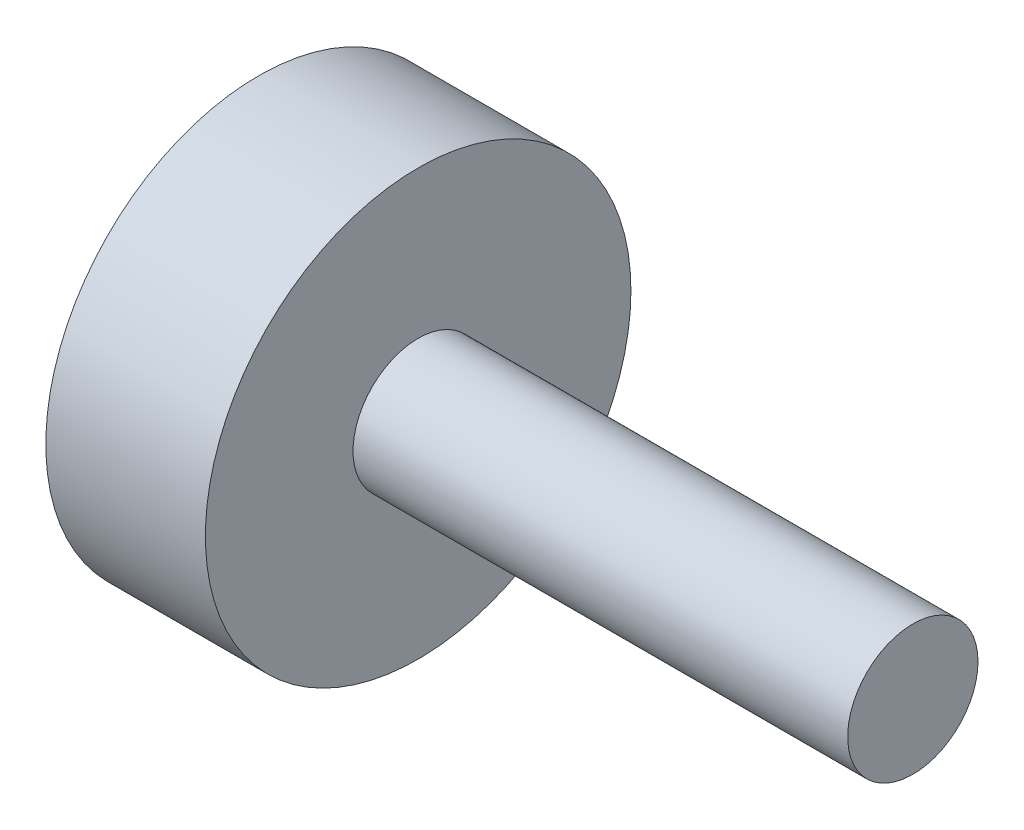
from build123d import *

# Parameters (mm, degrees)
ESBO_O1_R                = 4
ESBO_O1_R_2              = 1.025
RESSALTO_EXTRUS_O1_DEPTH = 3
ESBO_O2_R                = 1.225
RESSALTO_EXTRUS_O2_DEPTH = 9.3


with BuildPart() as part:
    # Esbo_o1 → Ressalto-extrus_o1 (new body)
    with BuildSketch(Plane(origin=(0, 0, 0), x_dir=(0, 0, -1), z_dir=(1, 0, 0))):
        Circle(ESBO_O1_R)
        Circle(ESBO_O1_R_2, mode=Mode.SUBTRACT)
    extrude(amount=RESSALTO_EXTRUS_O1_DEPTH)

    # Esbo_o2 → Ressalto-extrus_o2 (add)
    with BuildSketch(Plane(origin=(3, 0, 0), x_dir=(0, 0, -1), z_dir=(1, 0, 0))):
        Circle(ESBO_O2_R)
    extrude(amount=RESSALTO_EXTRUS_O2_DEPTH)


solid = part.part
